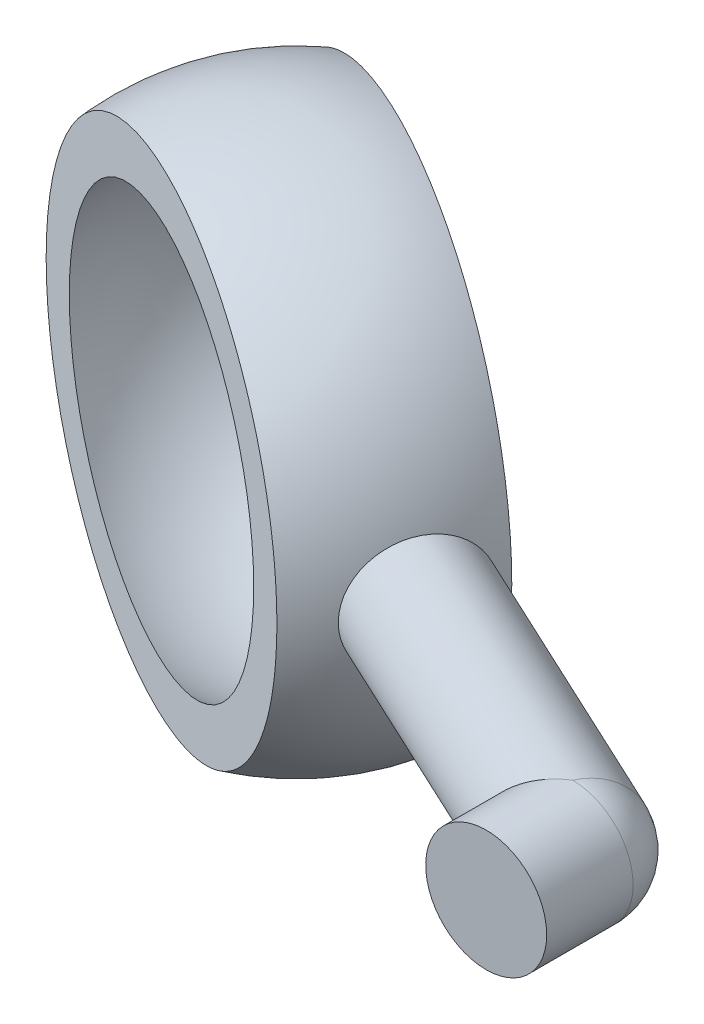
from build123d import *

# Parameters (mm, degrees)
ESQUISSE10_R                 = 3.5
EXTRUSION3_DEPTH             = 5
ENL_V_MAT_EXTRU_4_DEPTH      = 45.00000000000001
ENL_V_MAT_EXTRU_4_DEPTH_BACK = 35


with BuildPart() as part:
    # Esquisse10 → Extrusion3 (new body)
    with BuildSketch(Plane.XY):
        Circle(ESQUISSE10_R)
    extrude(amount=EXTRUSION3_DEPTH)

    # Esquisse11 → R_volution3 (revolve)
    with BuildSketch(Plane(origin=(0, 0, 0), x_dir=(1, 0, 0), z_dir=(0, 1, 0)), mode=Mode.PRIVATE) as r_volution3_sk:
        Polygon((0, 0), (-1.4791639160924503, -3.172077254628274), (-31.387320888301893, 10.774325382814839), (-29.90815697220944, 13.946402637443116), align=None)
    revolve(r_volution3_sk.sketch.rotate(Axis((0, 0, 0), (-0.9063077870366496, 0, -0.42261826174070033)), 180), axis=Axis((0, 0, 0), (-0.9063077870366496, 0, -0.42261826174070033)))

    # Esquisse12 → R_volution4 (revolve)
    with BuildSketch(Plane(origin=(0, 0, 0), x_dir=(1, 0, 0), z_dir=(0, 1, 0))):
        with BuildLine():
            Line((-29.90815697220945, 28.94640263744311), (-29.908156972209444, -1.053597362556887))
            ThreePointArc((-29.908156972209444, -1.053597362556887), (-14.908156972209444, 13.946402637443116), (-29.90815697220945, 28.94640263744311))
        make_face()
    revolve(axis=Axis((-29.90815697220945, 0, -32.720787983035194), (1.3e-16, 0, 1)))

    # Esquisse13 → Enl_vement de mati_re-R_volution4 (revolve, cut)
    with BuildSketch(Plane(origin=(0, 0, 0), x_dir=(1, 0, 0), z_dir=(0, 1, 0))):
        with BuildLine():
            Line((-29.908156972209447, 26.446402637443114), (-29.908156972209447, 1.4464026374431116))
            ThreePointArc((-29.908156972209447, 1.4464026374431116), (-17.408156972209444, 13.946402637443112), (-29.908156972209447, 26.446402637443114))
        make_face()
    revolve(axis=Axis((-29.90815697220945, 0, -28.62499877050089), (1e-16, 0, 1)), mode=Mode.SUBTRACT)

    # Esquisse14 → Enl_v. mat.-Extru.4 (cut, two sides: drawn at the far end of the back side and taken through both)
    with BuildSketch(Plane(origin=(0, 0, 0), x_dir=(1, 0, 0), z_dir=(0, 1, 0)).offset(-ENL_V_MAT_EXTRU_4_DEPTH_BACK)):
        with BuildLine():
            Line((-1.9408302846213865, 5.442779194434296), (-48.96151480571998, 27.368884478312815))
            ThreePointArc((-48.96151480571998, 27.368884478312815), (-16.399422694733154, 35.81737203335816), (-1.9408302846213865, 5.442779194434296))
        make_face()
        with BuildLine():
            Line((-6.167012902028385, -3.620298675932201), (-53.18769742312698, 18.30580660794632))
            ThreePointArc((-53.18769742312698, 18.30580660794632), (-38.72910501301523, -12.068786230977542), (-6.167012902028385, -3.620298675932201))
        make_face()
    extrude(amount=ENL_V_MAT_EXTRU_4_DEPTH + ENL_V_MAT_EXTRU_4_DEPTH_BACK, mode=Mode.SUBTRACT)

    # Esquisse15 → R_volution5 (revolve)
    with BuildSketch(Plane(origin=(0, 0, 0), x_dir=(0.42261826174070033, 0, -0.9063077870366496), z_dir=(0.9063077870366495, 0, 0.4226182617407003))):
        with BuildLine():
            Line((2.1e-16, 3.5), (-6.4e-16, -3.5))
            ThreePointArc((-6.4e-16, -3.5), (3.5, -7.8e-16), (2.1e-16, 3.5))
        make_face()
    revolve(axis=Axis((6e-17, 12.834248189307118, -1.4e-16), (0, -1, 1e-17)))


solid = part.part
